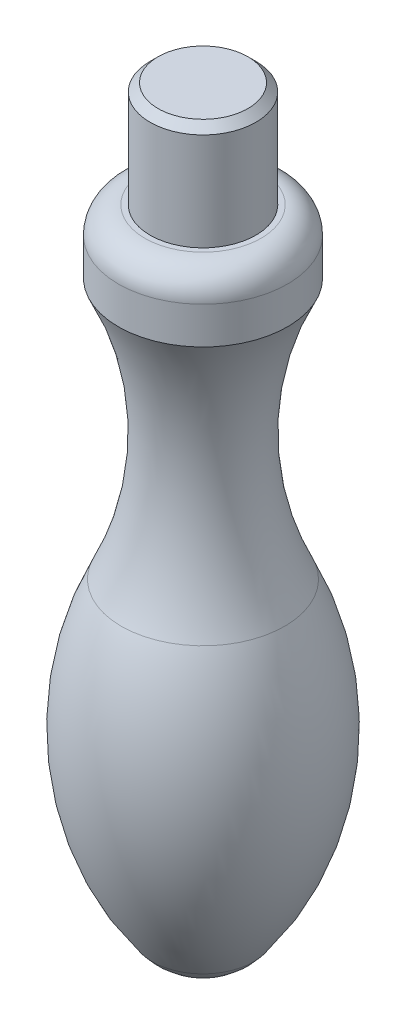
ISO-10303-21;
HEADER;
FILE_DESCRIPTION(('STEP AP214'),'2;1');
FILE_NAME('part.step','',(''),(''),'','','');
FILE_SCHEMA(('AUTOMOTIVE_DESIGN { 1 0 10303 214 1 1 1 1 }'));
ENDSEC;
DATA;
#1=APPLICATION_CONTEXT('core data for automotive mechanical design processes');
#2=APPLICATION_PROTOCOL_DEFINITION('international standard','automotive_design',2000,#1);
#3=PRODUCT_CONTEXT('',#1,'mechanical');
#4=PRODUCT('Part','Part','',(#3));
#5=PRODUCT_RELATED_PRODUCT_CATEGORY('part','',(#4));
#6=PRODUCT_DEFINITION_FORMATION('','',#4);
#7=PRODUCT_DEFINITION_CONTEXT('part definition',#1,'design');
#8=PRODUCT_DEFINITION('design','',#6,#7);
#9=PRODUCT_DEFINITION_SHAPE('','',#8);
#10=(LENGTH_UNIT() NAMED_UNIT(*) SI_UNIT(.MILLI.,.METRE.));
#11=(NAMED_UNIT(*) PLANE_ANGLE_UNIT() SI_UNIT($,.RADIAN.));
#12=(NAMED_UNIT(*) SI_UNIT($,.STERADIAN.) SOLID_ANGLE_UNIT());
#13=UNCERTAINTY_MEASURE_WITH_UNIT(LENGTH_MEASURE(1.E-05),#10,'distance_accuracy_value','');
#14=(GEOMETRIC_REPRESENTATION_CONTEXT(3) GLOBAL_UNCERTAINTY_ASSIGNED_CONTEXT((#13)) GLOBAL_UNIT_ASSIGNED_CONTEXT((#10,
#11,#12)) REPRESENTATION_CONTEXT('',''));
#15=CARTESIAN_POINT('',(0.,0.,0.));
#16=DIRECTION('',(0.,0.,1.));
#17=DIRECTION('',(1.,0.,0.));
#18=AXIS2_PLACEMENT_3D('',#15,#16,#17);
#19=CARTESIAN_POINT('',(0.,-66.,0.));
#20=DIRECTION('',(0.,1.,0.));
#21=DIRECTION('',(1.,0.,0.));
#22=AXIS2_PLACEMENT_3D('',#19,#20,#21);
#23=SPHERICAL_SURFACE('',#22,6.00000000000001);
#24=CARTESIAN_POINT('',(0.,-69.6208955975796,0.));
#25=DIRECTION('',(0.,1.,0.));
#26=DIRECTION('',(0.,0.,1.));
#27=AXIS2_PLACEMENT_3D('',#24,#25,#26);
#28=CIRCLE('',#27,4.78425700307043);
#29=CARTESIAN_POINT('',(0.,-69.6208955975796,4.78425700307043));
#30=VERTEX_POINT('',#29);
#31=EDGE_CURVE('E34',#30,#30,#28,.T.);
#32=ORIENTED_EDGE('',*,*,#31,.F.);
#33=EDGE_LOOP('',(#32));
#34=FACE_BOUND('',#33,.T.);
#35=ADVANCED_FACE('F24',(#34),#23,.T.);
#36=CARTESIAN_POINT('',(0.,-52.7233828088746,0.));
#37=DIRECTION('',(0.,1.,0.));
#38=DIRECTION('',(0.,0.,1.));
#39=AXIS2_PLACEMENT_3D('',#36,#37,#38);
#40=DEGENERATE_TOROIDAL_SURFACE('',#39,17.5422756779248,28.,.F.);
#41=CARTESIAN_POINT('',(0.,-40.6664515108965,0.));
#42=DIRECTION('',(0.,1.,0.));
#43=DIRECTION('',(0.,0.,1.));
#44=AXIS2_PLACEMENT_3D('',#41,#42,#43);
#45=CIRCLE('',#44,7.7288621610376);
#46=CARTESIAN_POINT('',(0.,-40.6664515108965,7.7288621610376));
#47=VERTEX_POINT('',#46);
#48=EDGE_CURVE('E38',#47,#47,#45,.T.);
#49=ORIENTED_EDGE('',*,*,#48,.F.);
#50=EDGE_LOOP('',(#49));
#51=FACE_BOUND('',#50,.T.);
#52=ORIENTED_EDGE('',*,*,#31,.T.);
#53=EDGE_LOOP('',(#52));
#54=FACE_BOUND('',#53,.T.);
#55=ADVANCED_FACE('F79',(#51,#54),#40,.F.);
#56=CARTESIAN_POINT('',(0.,-28.6095202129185,0.));
#57=DIRECTION('',(0.,1.,0.));
#58=DIRECTION('',(0.,0.,1.));
#59=AXIS2_PLACEMENT_3D('',#56,#57,#58);
#60=TOROIDAL_SURFACE('',#59,33.,28.);
#61=CARTESIAN_POINT('',(0.,-16.,0.));
#62=DIRECTION('',(0.,1.,0.));
#63=DIRECTION('',(0.,0.,1.));
#64=AXIS2_PLACEMENT_3D('',#61,#62,#63);
#65=CIRCLE('',#64,8.);
#66=CARTESIAN_POINT('',(0.,-16.,8.00000000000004));
#67=VERTEX_POINT('',#66);
#68=EDGE_CURVE('E43',#67,#67,#65,.T.);
#69=ORIENTED_EDGE('',*,*,#68,.F.);
#70=EDGE_LOOP('',(#69));
#71=FACE_BOUND('',#70,.T.);
#72=ORIENTED_EDGE('',*,*,#48,.T.);
#73=EDGE_LOOP('',(#72));
#74=FACE_BOUND('',#73,.T.);
#75=ADVANCED_FACE('F73',(#71,#74),#60,.F.);
#76=CARTESIAN_POINT('',(0.,0.,0.));
#77=DIRECTION('',(0.,1.,0.));
#78=DIRECTION('',(0.,0.,1.));
#79=AXIS2_PLACEMENT_3D('',#76,#77,#78);
#80=CYLINDRICAL_SURFACE('',#79,8.);
#81=CARTESIAN_POINT('',(0.,-12.5,0.));
#82=DIRECTION('',(0.,1.,0.));
#83=DIRECTION('',(0.,0.,1.));
#84=AXIS2_PLACEMENT_3D('',#81,#82,#83);
#85=CIRCLE('',#84,8.);
#86=CARTESIAN_POINT('',(0.,-12.5,8.00000000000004));
#87=VERTEX_POINT('',#86);
#88=EDGE_CURVE('E46',#87,#87,#85,.T.);
#89=ORIENTED_EDGE('',*,*,#88,.F.);
#90=EDGE_LOOP('',(#89));
#91=FACE_BOUND('',#90,.T.);
#92=ORIENTED_EDGE('',*,*,#68,.T.);
#93=EDGE_LOOP('',(#92));
#94=FACE_BOUND('',#93,.T.);
#95=ADVANCED_FACE('F67',(#91,#94),#80,.T.);
#96=CARTESIAN_POINT('',(0.,-12.5,0.));
#97=DIRECTION('',(0.,1.,0.));
#98=DIRECTION('',(0.,0.,1.));
#99=AXIS2_PLACEMENT_3D('',#96,#97,#98);
#100=TOROIDAL_SURFACE('',#99,5.5,2.5);
#101=CARTESIAN_POINT('',(0.,-10.,0.));
#102=DIRECTION('',(0.,1.,0.));
#103=DIRECTION('',(0.,0.,1.));
#104=AXIS2_PLACEMENT_3D('',#101,#102,#103);
#105=CIRCLE('',#104,5.5);
#106=CARTESIAN_POINT('',(0.,-10.,5.50000000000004));
#107=VERTEX_POINT('',#106);
#108=EDGE_CURVE('E49',#107,#107,#105,.T.);
#109=ORIENTED_EDGE('',*,*,#108,.F.);
#110=EDGE_LOOP('',(#109));
#111=FACE_BOUND('',#110,.T.);
#112=ORIENTED_EDGE('',*,*,#88,.T.);
#113=EDGE_LOOP('',(#112));
#114=FACE_BOUND('',#113,.T.);
#115=ADVANCED_FACE('F61',(#111,#114),#100,.T.);
#116=CARTESIAN_POINT('',(4.99999999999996,-10.,0.));
#117=DIRECTION('',(0.,-1.,0.));
#118=DIRECTION('',(0.,0.,-1.));
#119=AXIS2_PLACEMENT_3D('',#116,#117,#118);
#120=PLANE('',#119);
#121=CARTESIAN_POINT('',(0.,-10.,0.));
#122=DIRECTION('',(0.,1.,0.));
#123=DIRECTION('',(0.,0.,1.));
#124=AXIS2_PLACEMENT_3D('',#121,#122,#123);
#125=CIRCLE('',#124,5.);
#126=CARTESIAN_POINT('',(0.,-10.,5.00000000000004));
#127=VERTEX_POINT('',#126);
#128=EDGE_CURVE('E52',#127,#127,#125,.T.);
#129=ORIENTED_EDGE('',*,*,#128,.F.);
#130=EDGE_LOOP('',(#129));
#131=FACE_BOUND('',#130,.T.);
#132=ORIENTED_EDGE('',*,*,#108,.T.);
#133=EDGE_LOOP('',(#132));
#134=FACE_BOUND('',#133,.T.);
#135=ADVANCED_FACE('F58',(#131,#134),#120,.F.);
#136=CARTESIAN_POINT('',(0.,0.,0.));
#137=DIRECTION('',(0.,1.,0.));
#138=DIRECTION('',(0.,0.,1.));
#139=AXIS2_PLACEMENT_3D('',#136,#137,#138);
#140=CYLINDRICAL_SURFACE('',#139,5.);
#141=CARTESIAN_POINT('',(0.,-0.750000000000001,0.));
#142=DIRECTION('',(0.,-1.,0.));
#143=DIRECTION('',(0.,0.,-1.));
#144=AXIS2_PLACEMENT_3D('',#141,#142,#143);
#145=CIRCLE('',#144,5.);
#146=CARTESIAN_POINT('',(0.,-0.750000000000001,-5.));
#147=VERTEX_POINT('',#146);
#148=EDGE_CURVE('E10',#147,#147,#145,.T.);
#149=ORIENTED_EDGE('',*,*,#148,.T.);
#150=EDGE_LOOP('',(#149));
#151=FACE_BOUND('',#150,.T.);
#152=ORIENTED_EDGE('',*,*,#128,.T.);
#153=EDGE_LOOP('',(#152));
#154=FACE_BOUND('',#153,.T.);
#155=ADVANCED_FACE('F56',(#151,#154),#140,.T.);
#156=CARTESIAN_POINT('',(0.,0.,0.));
#157=DIRECTION('',(0.,-1.,0.));
#158=DIRECTION('',(0.,0.,-1.));
#159=AXIS2_PLACEMENT_3D('',#156,#157,#158);
#160=PLANE('',#159);
#161=CARTESIAN_POINT('',(0.,0.,0.));
#162=DIRECTION('',(0.,-1.,0.));
#163=DIRECTION('',(0.,0.,-1.));
#164=AXIS2_PLACEMENT_3D('',#161,#162,#163);
#165=CIRCLE('',#164,4.25);
#166=CARTESIAN_POINT('',(0.,0.,-4.25));
#167=VERTEX_POINT('',#166);
#168=EDGE_CURVE('E30',#167,#167,#165,.F.);
#169=ORIENTED_EDGE('',*,*,#168,.T.);
#170=EDGE_LOOP('',(#169));
#171=FACE_BOUND('',#170,.T.);
#172=ADVANCED_FACE('F116',(#171),#160,.F.);
#173=CARTESIAN_POINT('',(0.,0.,0.));
#174=DIRECTION('',(0.,-1.,0.));
#175=DIRECTION('',(0.,0.,-1.));
#176=AXIS2_PLACEMENT_3D('',#173,#174,#175);
#177=CONICAL_SURFACE('',#176,4.25,0.785398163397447);
#178=CARTESIAN_POINT('',(0.,-0.750000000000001,-5.));
#179=CARTESIAN_POINT('',(0.,-0.742187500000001,-4.9921875));
#180=CARTESIAN_POINT('',(0.,-0.734375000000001,-4.984375));
#181=CARTESIAN_POINT('',(0.,-0.718750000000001,-4.96875));
#182=CARTESIAN_POINT('',(0.,-0.710937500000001,-4.9609375));
#183=CARTESIAN_POINT('',(0.,-0.695312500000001,-4.9453125));
#184=CARTESIAN_POINT('',(0.,-0.687500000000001,-4.9375));
#185=CARTESIAN_POINT('',(0.,-0.671875,-4.921875));
#186=CARTESIAN_POINT('',(0.,-0.6640625,-4.9140625));
#187=CARTESIAN_POINT('',(0.,-0.6484375,-4.8984375));
#188=CARTESIAN_POINT('',(0.,-0.640625,-4.890625));
#189=CARTESIAN_POINT('',(0.,-0.625,-4.875));
#190=CARTESIAN_POINT('',(0.,-0.6171875,-4.8671875));
#191=CARTESIAN_POINT('',(0.,-0.6015625,-4.8515625));
#192=CARTESIAN_POINT('',(0.,-0.59375,-4.84375));
#193=CARTESIAN_POINT('',(0.,-0.578125,-4.828125));
#194=CARTESIAN_POINT('',(0.,-0.5703125,-4.8203125));
#195=CARTESIAN_POINT('',(0.,-0.5546875,-4.8046875));
#196=CARTESIAN_POINT('',(0.,-0.546875,-4.796875));
#197=CARTESIAN_POINT('',(0.,-0.53125,-4.78125));
#198=CARTESIAN_POINT('',(0.,-0.5234375,-4.7734375));
#199=CARTESIAN_POINT('',(0.,-0.5078125,-4.7578125));
#200=CARTESIAN_POINT('',(0.,-0.5,-4.75));
#201=CARTESIAN_POINT('',(0.,-0.484375,-4.734375));
#202=CARTESIAN_POINT('',(0.,-0.4765625,-4.7265625));
#203=CARTESIAN_POINT('',(0.,-0.4609375,-4.7109375));
#204=CARTESIAN_POINT('',(0.,-0.453125,-4.703125));
#205=CARTESIAN_POINT('',(0.,-0.4375,-4.6875));
#206=CARTESIAN_POINT('',(0.,-0.4296875,-4.6796875));
#207=CARTESIAN_POINT('',(0.,-0.4140625,-4.6640625));
#208=CARTESIAN_POINT('',(0.,-0.40625,-4.65625));
#209=CARTESIAN_POINT('',(0.,-0.390625,-4.640625));
#210=CARTESIAN_POINT('',(0.,-0.3828125,-4.6328125));
#211=CARTESIAN_POINT('',(0.,-0.3671875,-4.6171875));
#212=CARTESIAN_POINT('',(0.,-0.359375,-4.609375));
#213=CARTESIAN_POINT('',(0.,-0.34375,-4.59375));
#214=CARTESIAN_POINT('',(0.,-0.3359375,-4.5859375));
#215=CARTESIAN_POINT('',(0.,-0.3203125,-4.5703125));
#216=CARTESIAN_POINT('',(0.,-0.3125,-4.5625));
#217=CARTESIAN_POINT('',(0.,-0.296875,-4.546875));
#218=CARTESIAN_POINT('',(0.,-0.2890625,-4.5390625));
#219=CARTESIAN_POINT('',(0.,-0.2734375,-4.5234375));
#220=CARTESIAN_POINT('',(0.,-0.265625,-4.515625));
#221=CARTESIAN_POINT('',(0.,-0.25,-4.5));
#222=CARTESIAN_POINT('',(0.,-0.2421875,-4.4921875));
#223=CARTESIAN_POINT('',(0.,-0.2265625,-4.4765625));
#224=CARTESIAN_POINT('',(0.,-0.21875,-4.46875));
#225=CARTESIAN_POINT('',(0.,-0.203125,-4.453125));
#226=CARTESIAN_POINT('',(0.,-0.1953125,-4.4453125));
#227=CARTESIAN_POINT('',(0.,-0.1796875,-4.4296875));
#228=CARTESIAN_POINT('',(0.,-0.171875,-4.421875));
#229=CARTESIAN_POINT('',(0.,-0.15625,-4.40625));
#230=CARTESIAN_POINT('',(0.,-0.1484375,-4.3984375));
#231=CARTESIAN_POINT('',(0.,-0.1328125,-4.3828125));
#232=CARTESIAN_POINT('',(0.,-0.125,-4.375));
#233=CARTESIAN_POINT('',(0.,-0.109375,-4.359375));
#234=CARTESIAN_POINT('',(0.,-0.1015625,-4.3515625));
#235=CARTESIAN_POINT('',(0.,-0.0859375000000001,-4.3359375));
#236=CARTESIAN_POINT('',(0.,-0.0781250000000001,-4.328125));
#237=CARTESIAN_POINT('',(0.,-0.0625,-4.3125));
#238=CARTESIAN_POINT('',(0.,-0.0546875,-4.3046875));
#239=CARTESIAN_POINT('',(0.,-0.0390625,-4.2890625));
#240=CARTESIAN_POINT('',(0.,-0.03125,-4.28125));
#241=CARTESIAN_POINT('',(0.,-0.015625,-4.265625));
#242=CARTESIAN_POINT('',(0.,-0.00781250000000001,-4.2578125));
#243=CARTESIAN_POINT('',(0.,0.,-4.25));
#244=B_SPLINE_CURVE_WITH_KNOTS('',3,(#178,#179,#180,#181,#182,#183,#184,#185,#186,#187,#188,
#189,#190,#191,#192,#193,#194,#195,#196,#197,#198,#199,#200,#201,#202,#203,#204,#205,#206,#207,
#208,#209,#210,#211,#212,#213,#214,#215,#216,#217,#218,#219,#220,#221,#222,#223,#224,#225,#226,
#227,#228,#229,#230,#231,#232,#233,#234,#235,#236,#237,#238,#239,#240,#241,#242,#243),
.UNSPECIFIED.,.F.,.F.,(4,2,2,2,2,2,2,2,2,2,2,2,2,2,2,2,2,2,2,2,2,2,2,2,2,2,2,2,2,2,2,2,4),(0.,
0.0331456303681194,0.0662912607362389,0.0994368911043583,0.132582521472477,0.165728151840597,
0.198873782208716,0.232019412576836,0.265165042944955,0.298310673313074,0.331456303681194,
0.364601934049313,0.397747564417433,0.430893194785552,0.464038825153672,0.497184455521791,
0.53033008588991,0.563475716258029,0.596621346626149,0.629766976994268,0.662912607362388,
0.696058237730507,0.729203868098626,0.762349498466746,0.795495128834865,0.828640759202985,
0.861786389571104,0.894932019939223,0.928077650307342,0.961223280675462,0.994368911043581,
1.0275145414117,1.06066017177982),.UNSPECIFIED.);
#245=EDGE_CURVE('BSEAM123',#147,#167,#244,.T.);
#246=ORIENTED_EDGE('',*,*,#148,.F.);
#247=ORIENTED_EDGE('',*,*,#168,.F.);
#248=ORIENTED_EDGE('',*,*,#245,.T.);
#249=ORIENTED_EDGE('',*,*,#245,.F.);
#250=EDGE_LOOP('',(#246,#248,#247,#249));
#251=FACE_BOUND('',#250,.T.);
#252=ADVANCED_FACE('F123',(#251),#177,.T.);
#253=CLOSED_SHELL('',(#35,#55,#75,#95,#115,#135,#155,#172,#252));
#254=MANIFOLD_SOLID_BREP('B2',#253);
#255=ADVANCED_BREP_SHAPE_REPRESENTATION('',(#18,#254),#14);
#256=SHAPE_DEFINITION_REPRESENTATION(#9,#255);
ENDSEC;
END-ISO-10303-21;
